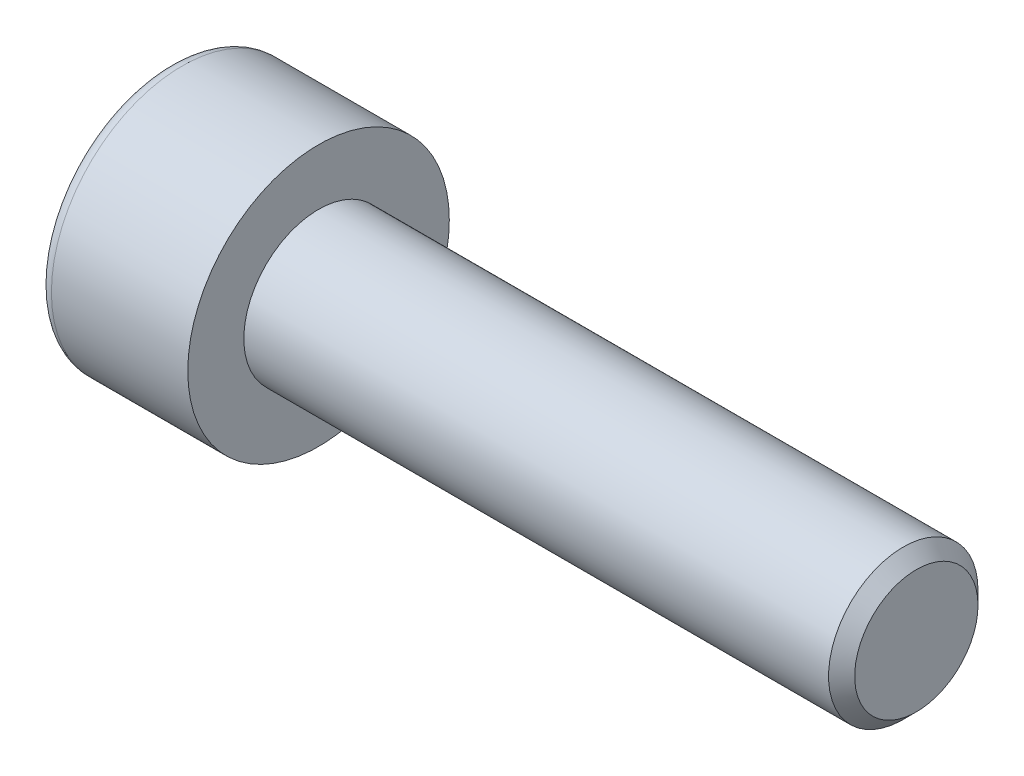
from build123d import *

# Parameters (mm, degrees)
CHANFREIN_TIGE_SIZE     = 0.35
CONG_TETE_R             = 0.35
ENL_V_MAT_EXTRU_1_DEPTH = 2.4


with BuildPart() as part:
    # Esquisse1 → Base-R_volution (revolve)
    with BuildSketch(Plane.XY, mode=Mode.PRIVATE) as base_r_volution_sk:
        Polygon((0, 2), (0, 3.5), (-4, 3.5), (-4, 0), (16, 0), (16, 2), align=None)
    revolve(base_r_volution_sk.sketch.rotate(Axis((12.501307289, 0, 0), (-1, 0, 0)), 90), axis=Axis((12.501307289, 0, 0), (-1, 0, 0)))

    # Chanfrein tige
    chanfrein_tige_edges = [part.edges().sort_by_distance(p)[0] for p in [
        (16, 0, 2),
    ]]
    chamfer(chanfrein_tige_edges, length=CHANFREIN_TIGE_SIZE)

    # Cong_ tete
    cong_tete_edges = [part.edges().sort_by_distance(p)[0] for p in [
        (-4, 0, 3.5),
    ]]
    fillet(cong_tete_edges, radius=CONG_TETE_R)

    # Esquisse2 → Enl_v. mat.-Extru.1 (cut)
    with BuildSketch(Plane.ZY.offset(4)):
        Polygon((1.732050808, 0), (0.866025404, 1.5), (-0.866025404, 1.5), (-1.732050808, 0), (-0.866025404, -1.5), (0.866025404, -1.5), align=None)
    extrude(amount=-ENL_V_MAT_EXTRU_1_DEPTH, mode=Mode.SUBTRACT)


solid = part.part
